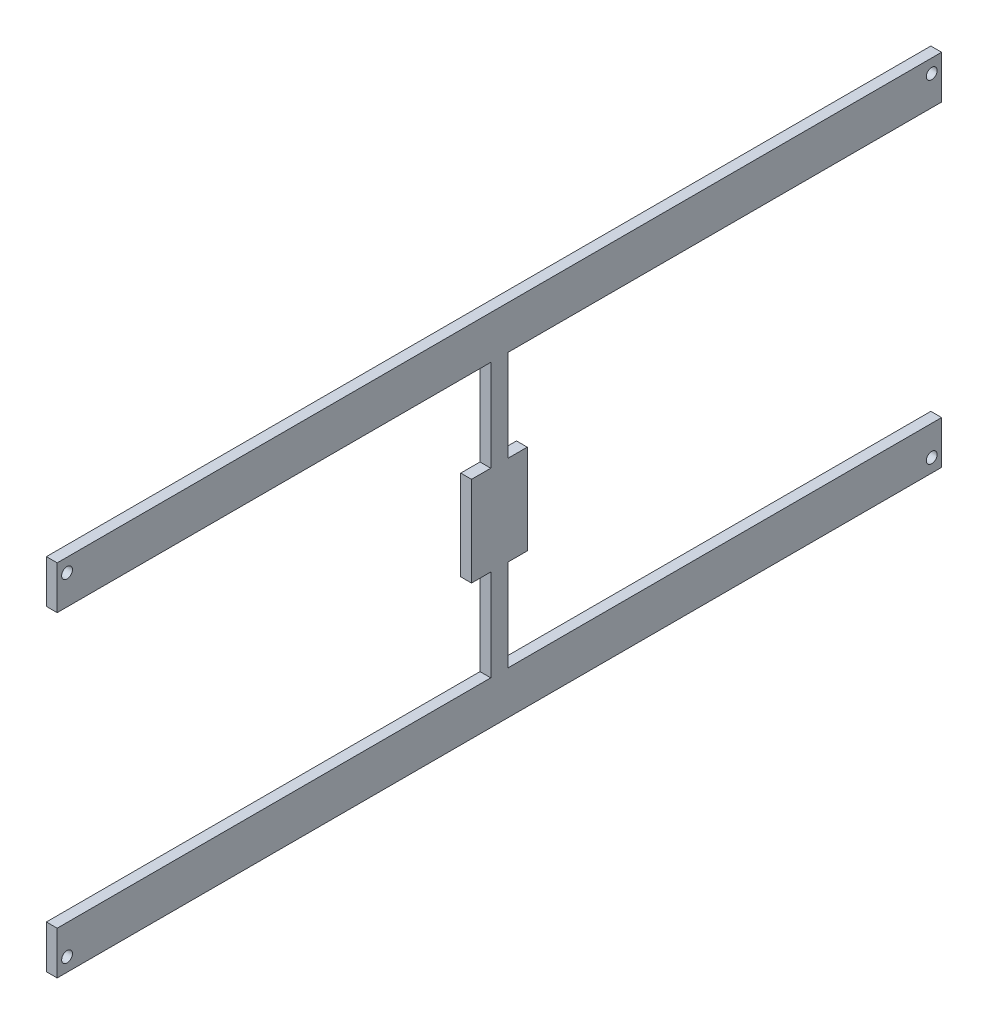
from build123d import *

# Parameters (mm, degrees)
SKIZZE1_R                       = 1.5
AUFSATZ_LINEAR_AUSTRAGEN1_DEPTH = 3


with BuildPart() as part:
    # Skizze1 → Aufsatz-Linear austragen1 (new body)
    with BuildSketch(Plane(origin=(0, 0, 0), x_dir=(0, 0, -1), z_dir=(1, 0, 0))):
        Polygon((123, 14.898295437), (2.4, 14.898295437), (-123, 14.898295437), (-123, 2.898295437), (-2.4, 2.898295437), (-2.4, -22.601704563), (-7.75, -22.601704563), (-7.75, -47.601704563), (-2.4, -47.601704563), (-2.4, -73.101704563), (-123, -73.101704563), (-123, -85.101704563), (2.4, -85.101704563), (123, -85.101704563), (123, -73.101704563), (2.4, -73.101704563), (2.4, -47.601704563), (7.75, -47.601704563), (7.75, -22.601704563), (2.4, -22.601704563), (2.4, 2.898295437), (123, 2.898295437), align=None)
        with Locations((120.25, 11.148295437)):
            Circle(SKIZZE1_R, mode=Mode.SUBTRACT)
        with Locations((120.25, -81.351704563)):
            Circle(SKIZZE1_R, mode=Mode.SUBTRACT)
        with Locations((-120.25, 11.148295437)):
            Circle(SKIZZE1_R, mode=Mode.SUBTRACT)
        with Locations((-120.25, -81.351704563)):
            Circle(SKIZZE1_R, mode=Mode.SUBTRACT)
    extrude(amount=AUFSATZ_LINEAR_AUSTRAGEN1_DEPTH)


solid = part.part
